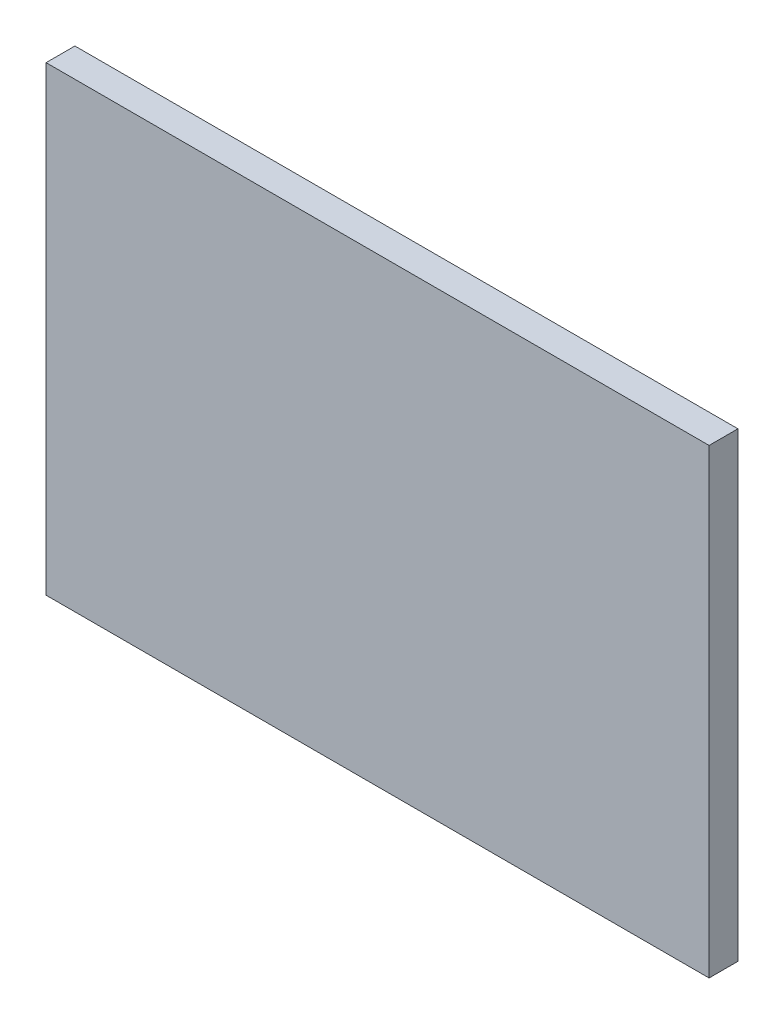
ISO-10303-21;
HEADER;
FILE_DESCRIPTION(('STEP AP214'),'2;1');
FILE_NAME('part.step','',(''),(''),'','','');
FILE_SCHEMA(('AUTOMOTIVE_DESIGN { 1 0 10303 214 1 1 1 1 }'));
ENDSEC;
DATA;
#1=APPLICATION_CONTEXT('core data for automotive mechanical design processes');
#2=APPLICATION_PROTOCOL_DEFINITION('international standard','automotive_design',2000,#1);
#3=PRODUCT_CONTEXT('',#1,'mechanical');
#4=PRODUCT('Part','Part','',(#3));
#5=PRODUCT_RELATED_PRODUCT_CATEGORY('part','',(#4));
#6=PRODUCT_DEFINITION_FORMATION('','',#4);
#7=PRODUCT_DEFINITION_CONTEXT('part definition',#1,'design');
#8=PRODUCT_DEFINITION('design','',#6,#7);
#9=PRODUCT_DEFINITION_SHAPE('','',#8);
#10=(LENGTH_UNIT() NAMED_UNIT(*) SI_UNIT(.MILLI.,.METRE.));
#11=(NAMED_UNIT(*) PLANE_ANGLE_UNIT() SI_UNIT($,.RADIAN.));
#12=(NAMED_UNIT(*) SI_UNIT($,.STERADIAN.) SOLID_ANGLE_UNIT());
#13=UNCERTAINTY_MEASURE_WITH_UNIT(LENGTH_MEASURE(1.E-05),#10,'distance_accuracy_value','');
#14=(GEOMETRIC_REPRESENTATION_CONTEXT(3) GLOBAL_UNCERTAINTY_ASSIGNED_CONTEXT((#13)) GLOBAL_UNIT_ASSIGNED_CONTEXT((#10,
#11,#12)) REPRESENTATION_CONTEXT('',''));
#15=CARTESIAN_POINT('',(0.,0.,0.));
#16=DIRECTION('',(0.,0.,1.));
#17=DIRECTION('',(1.,0.,0.));
#18=AXIS2_PLACEMENT_3D('',#15,#16,#17);
#19=CARTESIAN_POINT('',(73.025,-50.7999999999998,6.35000000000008));
#20=DIRECTION('',(-1.,0.,0.));
#21=DIRECTION('',(0.,0.,1.));
#22=AXIS2_PLACEMENT_3D('',#19,#20,#21);
#23=PLANE('',#22);
#24=DIRECTION('',(0.,1.,0.));
#25=VECTOR('',#24,1.);
#26=CARTESIAN_POINT('',(73.025,-50.7999999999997,-1.11022302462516E-13));
#27=LINE('',#26,#25);
#28=CARTESIAN_POINT('',(73.025,-50.7999999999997,-1.11022302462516E-13));
#29=VERTEX_POINT('',#28);
#30=CARTESIAN_POINT('',(73.025,50.8000000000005,-2.22044604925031E-13));
#31=VERTEX_POINT('',#30);
#32=EDGE_CURVE('E95',#29,#31,#27,.T.);
#33=ORIENTED_EDGE('',*,*,#32,.T.);
#34=DIRECTION('',(0.,0.,-1.));
#35=VECTOR('',#34,1.);
#36=CARTESIAN_POINT('',(73.0250000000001,50.8000000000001,6.34999999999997));
#37=LINE('',#36,#35);
#38=CARTESIAN_POINT('',(73.0250000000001,50.8000000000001,6.34999999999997));
#39=VERTEX_POINT('',#38);
#40=EDGE_CURVE('E11',#39,#31,#37,.T.);
#41=ORIENTED_EDGE('',*,*,#40,.F.);
#42=DIRECTION('',(0.,1.,0.));
#43=VECTOR('',#42,1.);
#44=CARTESIAN_POINT('',(73.025,-50.7999999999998,6.35000000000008));
#45=LINE('',#44,#43);
#46=CARTESIAN_POINT('',(73.025,-50.7999999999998,6.35000000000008));
#47=VERTEX_POINT('',#46);
#48=EDGE_CURVE('E83',#47,#39,#45,.T.);
#49=ORIENTED_EDGE('',*,*,#48,.F.);
#50=DIRECTION('',(0.,0.,-1.));
#51=VECTOR('',#50,1.);
#52=CARTESIAN_POINT('',(73.025,-50.7999999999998,6.35000000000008));
#53=LINE('',#52,#51);
#54=EDGE_CURVE('E91',#47,#29,#53,.T.);
#55=ORIENTED_EDGE('',*,*,#54,.T.);
#56=EDGE_LOOP('',(#33,#41,#49,#55));
#57=FACE_BOUND('',#56,.T.);
#58=ADVANCED_FACE('F32',(#57),#23,.F.);
#59=CARTESIAN_POINT('',(-73.0249999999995,50.8,6.34999999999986));
#60=DIRECTION('',(0.,-1.,0.));
#61=DIRECTION('',(0.,0.,-1.));
#62=AXIS2_PLACEMENT_3D('',#59,#60,#61);
#63=PLANE('',#62);
#64=DIRECTION('',(-1.,0.,0.));
#65=VECTOR('',#64,1.);
#66=CARTESIAN_POINT('',(-73.0249999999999,50.8000000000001,-1.11022302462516E-13));
#67=LINE('',#66,#65);
#68=CARTESIAN_POINT('',(-73.0249999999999,50.8000000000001,-1.11022302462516E-13));
#69=VERTEX_POINT('',#68);
#70=EDGE_CURVE('E87',#31,#69,#67,.T.);
#71=ORIENTED_EDGE('',*,*,#70,.T.);
#72=DIRECTION('',(0.,0.,-1.));
#73=VECTOR('',#72,1.);
#74=CARTESIAN_POINT('',(-73.0249999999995,50.8,6.34999999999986));
#75=LINE('',#74,#73);
#76=CARTESIAN_POINT('',(-73.0249999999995,50.8,6.34999999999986));
#77=VERTEX_POINT('',#76);
#78=EDGE_CURVE('E40',#77,#69,#75,.T.);
#79=ORIENTED_EDGE('',*,*,#78,.F.);
#80=DIRECTION('',(-1.,0.,0.));
#81=VECTOR('',#80,1.);
#82=CARTESIAN_POINT('',(-73.0249999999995,50.8,6.34999999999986));
#83=LINE('',#82,#81);
#84=EDGE_CURVE('E78',#39,#77,#83,.T.);
#85=ORIENTED_EDGE('',*,*,#84,.F.);
#86=ORIENTED_EDGE('',*,*,#40,.T.);
#87=EDGE_LOOP('',(#71,#79,#85,#86));
#88=FACE_BOUND('',#87,.T.);
#89=ADVANCED_FACE('F86',(#88),#63,.F.);
#90=CARTESIAN_POINT('',(-73.025,-50.7999999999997,6.35000000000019));
#91=DIRECTION('',(1.,0.,0.));
#92=DIRECTION('',(0.,0.,-1.));
#93=AXIS2_PLACEMENT_3D('',#90,#91,#92);
#94=PLANE('',#93);
#95=DIRECTION('',(0.,-1.,0.));
#96=VECTOR('',#95,1.);
#97=CARTESIAN_POINT('',(-73.025,-50.8000000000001,-1.11022302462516E-13));
#98=LINE('',#97,#96);
#99=CARTESIAN_POINT('',(-73.025,-50.8000000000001,-1.11022302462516E-13));
#100=VERTEX_POINT('',#99);
#101=EDGE_CURVE('E65',#69,#100,#98,.T.);
#102=ORIENTED_EDGE('',*,*,#101,.T.);
#103=DIRECTION('',(0.,0.,-1.));
#104=VECTOR('',#103,1.);
#105=CARTESIAN_POINT('',(-73.025,-50.7999999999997,6.35000000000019));
#106=LINE('',#105,#104);
#107=CARTESIAN_POINT('',(-73.025,-50.7999999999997,6.35000000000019));
#108=VERTEX_POINT('',#107);
#109=EDGE_CURVE('E88',#108,#100,#106,.T.);
#110=ORIENTED_EDGE('',*,*,#109,.F.);
#111=DIRECTION('',(0.,-1.,0.));
#112=VECTOR('',#111,1.);
#113=CARTESIAN_POINT('',(-73.025,-50.7999999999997,6.35000000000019));
#114=LINE('',#113,#112);
#115=EDGE_CURVE('E81',#77,#108,#114,.T.);
#116=ORIENTED_EDGE('',*,*,#115,.F.);
#117=ORIENTED_EDGE('',*,*,#78,.T.);
#118=EDGE_LOOP('',(#102,#110,#116,#117));
#119=FACE_BOUND('',#118,.T.);
#120=ADVANCED_FACE('F89',(#119),#94,.F.);
#121=CARTESIAN_POINT('',(-73.025,-50.7999999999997,6.35000000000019));
#122=DIRECTION('',(0.,1.,0.));
#123=DIRECTION('',(0.,0.,1.));
#124=AXIS2_PLACEMENT_3D('',#121,#122,#123);
#125=PLANE('',#124);
#126=DIRECTION('',(1.,0.,0.));
#127=VECTOR('',#126,1.);
#128=CARTESIAN_POINT('',(-73.025,-50.8000000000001,-1.11022302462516E-13));
#129=LINE('',#128,#127);
#130=EDGE_CURVE('E71',#100,#29,#129,.T.);
#131=ORIENTED_EDGE('',*,*,#130,.T.);
#132=ORIENTED_EDGE('',*,*,#54,.F.);
#133=DIRECTION('',(1.,0.,0.));
#134=VECTOR('',#133,1.);
#135=CARTESIAN_POINT('',(-73.025,-50.7999999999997,6.35000000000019));
#136=LINE('',#135,#134);
#137=EDGE_CURVE('E48',#108,#47,#136,.T.);
#138=ORIENTED_EDGE('',*,*,#137,.F.);
#139=ORIENTED_EDGE('',*,*,#109,.T.);
#140=EDGE_LOOP('',(#131,#132,#138,#139));
#141=FACE_BOUND('',#140,.T.);
#142=ADVANCED_FACE('F102',(#141),#125,.F.);
#143=CARTESIAN_POINT('',(73.0250000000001,50.8000000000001,6.34999999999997));
#144=DIRECTION('',(0.,0.,-1.));
#145=DIRECTION('',(-1.,0.,0.));
#146=AXIS2_PLACEMENT_3D('',#143,#144,#145);
#147=PLANE('',#146);
#148=ORIENTED_EDGE('',*,*,#48,.T.);
#149=ORIENTED_EDGE('',*,*,#84,.T.);
#150=ORIENTED_EDGE('',*,*,#115,.T.);
#151=ORIENTED_EDGE('',*,*,#137,.T.);
#152=EDGE_LOOP('',(#148,#149,#150,#151));
#153=FACE_BOUND('',#152,.T.);
#154=ADVANCED_FACE('F79',(#153),#147,.F.);
#155=CARTESIAN_POINT('',(73.025,50.8000000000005,-2.22044604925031E-13));
#156=DIRECTION('',(0.,0.,-1.));
#157=DIRECTION('',(-1.,0.,0.));
#158=AXIS2_PLACEMENT_3D('',#155,#156,#157);
#159=PLANE('',#158);
#160=ORIENTED_EDGE('',*,*,#32,.F.);
#161=ORIENTED_EDGE('',*,*,#130,.F.);
#162=ORIENTED_EDGE('',*,*,#101,.F.);
#163=ORIENTED_EDGE('',*,*,#70,.F.);
#164=EDGE_LOOP('',(#160,#161,#162,#163));
#165=FACE_BOUND('',#164,.T.);
#166=ADVANCED_FACE('F105',(#165),#159,.T.);
#167=CLOSED_SHELL('',(#58,#89,#120,#142,#154,#166));
#168=MANIFOLD_SOLID_BREP('B2',#167);
#169=ADVANCED_BREP_SHAPE_REPRESENTATION('',(#18,#168),#14);
#170=SHAPE_DEFINITION_REPRESENTATION(#9,#169);
ENDSEC;
END-ISO-10303-21;
